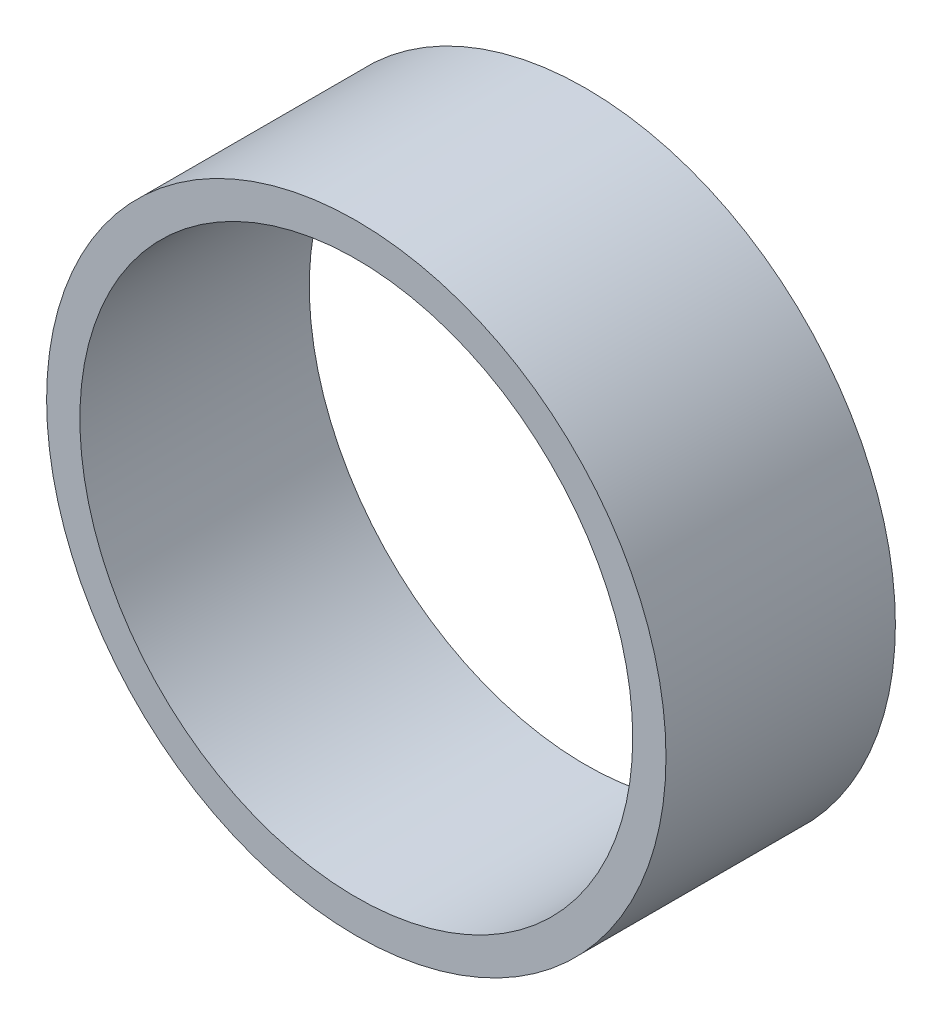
ISO-10303-21;
HEADER;
FILE_DESCRIPTION(('STEP AP214'),'2;1');
FILE_NAME('part.step','',(''),(''),'','','');
FILE_SCHEMA(('AUTOMOTIVE_DESIGN { 1 0 10303 214 1 1 1 1 }'));
ENDSEC;
DATA;
#1=APPLICATION_CONTEXT('core data for automotive mechanical design processes');
#2=APPLICATION_PROTOCOL_DEFINITION('international standard','automotive_design',2000,#1);
#3=PRODUCT_CONTEXT('',#1,'mechanical');
#4=PRODUCT('Part','Part','',(#3));
#5=PRODUCT_RELATED_PRODUCT_CATEGORY('part','',(#4));
#6=PRODUCT_DEFINITION_FORMATION('','',#4);
#7=PRODUCT_DEFINITION_CONTEXT('part definition',#1,'design');
#8=PRODUCT_DEFINITION('design','',#6,#7);
#9=PRODUCT_DEFINITION_SHAPE('','',#8);
#10=(LENGTH_UNIT() NAMED_UNIT(*) SI_UNIT(.MILLI.,.METRE.));
#11=(NAMED_UNIT(*) PLANE_ANGLE_UNIT() SI_UNIT($,.RADIAN.));
#12=(NAMED_UNIT(*) SI_UNIT($,.STERADIAN.) SOLID_ANGLE_UNIT());
#13=UNCERTAINTY_MEASURE_WITH_UNIT(LENGTH_MEASURE(1.E-05),#10,'distance_accuracy_value','');
#14=(GEOMETRIC_REPRESENTATION_CONTEXT(3) GLOBAL_UNCERTAINTY_ASSIGNED_CONTEXT((#13)) GLOBAL_UNIT_ASSIGNED_CONTEXT((#10,
#11,#12)) REPRESENTATION_CONTEXT('',''));
#15=CARTESIAN_POINT('',(0.,0.,0.));
#16=DIRECTION('',(0.,0.,1.));
#17=DIRECTION('',(1.,0.,0.));
#18=AXIS2_PLACEMENT_3D('',#15,#16,#17);
#19=CARTESIAN_POINT('',(0.,0.,20.));
#20=DIRECTION('',(0.,0.,1.));
#21=DIRECTION('',(1.,0.,0.));
#22=AXIS2_PLACEMENT_3D('',#19,#20,#21);
#23=PLANE('',#22);
#24=CARTESIAN_POINT('',(0.,0.,20.));
#25=DIRECTION('',(0.,0.,1.));
#26=DIRECTION('',(1.,0.,0.));
#27=AXIS2_PLACEMENT_3D('',#24,#25,#26);
#28=CIRCLE('',#27,27.);
#29=CARTESIAN_POINT('',(27.,0.,20.));
#30=VERTEX_POINT('',#29);
#31=EDGE_CURVE('E10',#30,#30,#28,.T.);
#32=ORIENTED_EDGE('',*,*,#31,.T.);
#33=EDGE_LOOP('',(#32));
#34=FACE_BOUND('',#33,.T.);
#35=CARTESIAN_POINT('',(0.,0.,20.));
#36=DIRECTION('',(0.,0.,1.));
#37=DIRECTION('',(1.,0.,0.));
#38=AXIS2_PLACEMENT_3D('',#35,#36,#37);
#39=CIRCLE('',#38,24.1);
#40=CARTESIAN_POINT('',(24.1,0.,20.));
#41=VERTEX_POINT('',#40);
#42=EDGE_CURVE('E41',#41,#41,#39,.T.);
#43=ORIENTED_EDGE('',*,*,#42,.F.);
#44=EDGE_LOOP('',(#43));
#45=FACE_BOUND('',#44,.T.);
#46=ADVANCED_FACE('F30',(#34,#45),#23,.T.);
#47=CARTESIAN_POINT('',(0.,0.,0.));
#48=DIRECTION('',(0.,0.,1.));
#49=DIRECTION('',(1.,0.,0.));
#50=AXIS2_PLACEMENT_3D('',#47,#48,#49);
#51=PLANE('',#50);
#52=CARTESIAN_POINT('',(0.,0.,0.));
#53=DIRECTION('',(0.,0.,1.));
#54=DIRECTION('',(1.,0.,0.));
#55=AXIS2_PLACEMENT_3D('',#52,#53,#54);
#56=CIRCLE('',#55,27.);
#57=CARTESIAN_POINT('',(27.,0.,0.));
#58=VERTEX_POINT('',#57);
#59=EDGE_CURVE('E37',#58,#58,#56,.T.);
#60=ORIENTED_EDGE('',*,*,#59,.F.);
#61=EDGE_LOOP('',(#60));
#62=FACE_BOUND('',#61,.T.);
#63=CARTESIAN_POINT('',(0.,0.,0.));
#64=DIRECTION('',(0.,0.,1.));
#65=DIRECTION('',(1.,0.,0.));
#66=AXIS2_PLACEMENT_3D('',#63,#64,#65);
#67=CIRCLE('',#66,24.1);
#68=CARTESIAN_POINT('',(24.1,0.,0.));
#69=VERTEX_POINT('',#68);
#70=EDGE_CURVE('E45',#69,#69,#67,.T.);
#71=ORIENTED_EDGE('',*,*,#70,.T.);
#72=EDGE_LOOP('',(#71));
#73=FACE_BOUND('',#72,.T.);
#74=ADVANCED_FACE('F51',(#62,#73),#51,.F.);
#75=CARTESIAN_POINT('',(0.,0.,20.));
#76=DIRECTION('',(0.,0.,-1.));
#77=DIRECTION('',(-1.,0.,0.));
#78=AXIS2_PLACEMENT_3D('',#75,#76,#77);
#79=CYLINDRICAL_SURFACE('',#78,27.);
#80=ORIENTED_EDGE('',*,*,#31,.F.);
#81=EDGE_LOOP('',(#80));
#82=FACE_BOUND('',#81,.T.);
#83=ORIENTED_EDGE('',*,*,#59,.T.);
#84=EDGE_LOOP('',(#83));
#85=FACE_BOUND('',#84,.T.);
#86=ADVANCED_FACE('F32',(#82,#85),#79,.T.);
#87=CARTESIAN_POINT('',(0.,0.,20.));
#88=DIRECTION('',(0.,0.,-1.));
#89=DIRECTION('',(-1.,0.,0.));
#90=AXIS2_PLACEMENT_3D('',#87,#88,#89);
#91=CYLINDRICAL_SURFACE('',#90,24.1);
#92=ORIENTED_EDGE('',*,*,#42,.T.);
#93=EDGE_LOOP('',(#92));
#94=FACE_BOUND('',#93,.T.);
#95=ORIENTED_EDGE('',*,*,#70,.F.);
#96=EDGE_LOOP('',(#95));
#97=FACE_BOUND('',#96,.T.);
#98=ADVANCED_FACE('F53',(#94,#97),#91,.F.);
#99=CLOSED_SHELL('',(#46,#74,#86,#98));
#100=MANIFOLD_SOLID_BREP('B2',#99);
#101=ADVANCED_BREP_SHAPE_REPRESENTATION('',(#18,#100),#14);
#102=SHAPE_DEFINITION_REPRESENTATION(#9,#101);
ENDSEC;
END-ISO-10303-21;
